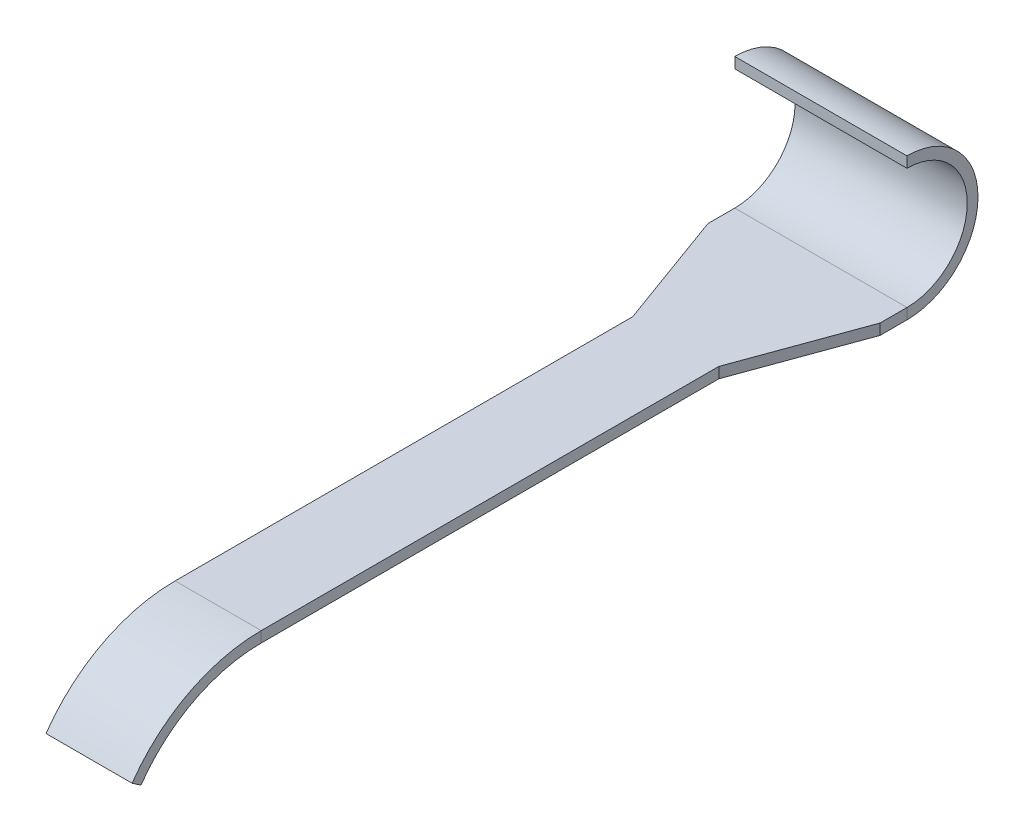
ISO-10303-21;
HEADER;
FILE_DESCRIPTION(('STEP AP214'),'2;1');
FILE_NAME('part.step','',(''),(''),'','','');
FILE_SCHEMA(('AUTOMOTIVE_DESIGN { 1 0 10303 214 1 1 1 1 }'));
ENDSEC;
DATA;
#1=APPLICATION_CONTEXT('core data for automotive mechanical design processes');
#2=APPLICATION_PROTOCOL_DEFINITION('international standard','automotive_design',2000,#1);
#3=PRODUCT_CONTEXT('',#1,'mechanical');
#4=PRODUCT('Part','Part','',(#3));
#5=PRODUCT_RELATED_PRODUCT_CATEGORY('part','',(#4));
#6=PRODUCT_DEFINITION_FORMATION('','',#4);
#7=PRODUCT_DEFINITION_CONTEXT('part definition',#1,'design');
#8=PRODUCT_DEFINITION('design','',#6,#7);
#9=PRODUCT_DEFINITION_SHAPE('','',#8);
#10=(LENGTH_UNIT() NAMED_UNIT(*) SI_UNIT(.MILLI.,.METRE.));
#11=(NAMED_UNIT(*) PLANE_ANGLE_UNIT() SI_UNIT($,.RADIAN.));
#12=(NAMED_UNIT(*) SI_UNIT($,.STERADIAN.) SOLID_ANGLE_UNIT());
#13=UNCERTAINTY_MEASURE_WITH_UNIT(LENGTH_MEASURE(1.E-05),#10,'distance_accuracy_value','');
#14=(GEOMETRIC_REPRESENTATION_CONTEXT(3) GLOBAL_UNCERTAINTY_ASSIGNED_CONTEXT((#13)) GLOBAL_UNIT_ASSIGNED_CONTEXT((#10,
#11,#12)) REPRESENTATION_CONTEXT('',''));
#15=CARTESIAN_POINT('',(0.,0.,0.));
#16=DIRECTION('',(0.,0.,1.));
#17=DIRECTION('',(1.,0.,0.));
#18=AXIS2_PLACEMENT_3D('',#15,#16,#17);
#19=CARTESIAN_POINT('',(19.05,-21.59,0.));
#20=DIRECTION('',(1.,0.,0.));
#21=DIRECTION('',(0.,0.,-1.));
#22=AXIS2_PLACEMENT_3D('',#19,#20,#21);
#23=PLANE('',#22);
#24=DIRECTION('',(0.,0.569606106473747,0.821917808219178));
#25=VECTOR('',#24,1.);
#26=CARTESIAN_POINT('',(19.05,-8.38795446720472,19.05));
#27=LINE('',#26,#25);
#28=CARTESIAN_POINT('',(19.05,-9.29220416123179,17.7452054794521));
#29=VERTEX_POINT('',#28);
#30=CARTESIAN_POINT('',(19.05,-8.38795446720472,19.05));
#31=VERTEX_POINT('',#30);
#32=EDGE_CURVE('E11',#29,#31,#27,.T.);
#33=ORIENTED_EDGE('',*,*,#32,.F.);
#34=CARTESIAN_POINT('',(19.05,-21.59,0.));
#35=DIRECTION('',(-1.,0.,0.));
#36=DIRECTION('',(0.,0.,1.));
#37=AXIS2_PLACEMENT_3D('',#34,#35,#36);
#38=CIRCLE('',#37,21.59);
#39=CARTESIAN_POINT('',(19.05,0.,0.));
#40=VERTEX_POINT('',#39);
#41=EDGE_CURVE('E118',#29,#40,#38,.T.);
#42=ORIENTED_EDGE('',*,*,#41,.T.);
#43=DIRECTION('',(0.,1.,0.));
#44=VECTOR('',#43,1.);
#45=CARTESIAN_POINT('',(19.05,1.5875,0.));
#46=LINE('',#45,#44);
#47=CARTESIAN_POINT('',(19.05,1.5875,0.));
#48=VERTEX_POINT('',#47);
#49=EDGE_CURVE('E51',#40,#48,#46,.T.);
#50=ORIENTED_EDGE('',*,*,#49,.T.);
#51=CARTESIAN_POINT('',(19.05,-21.59,0.));
#52=DIRECTION('',(-1.,0.,0.));
#53=DIRECTION('',(0.,0.,1.));
#54=AXIS2_PLACEMENT_3D('',#51,#52,#53);
#55=CIRCLE('',#54,23.1775);
#56=EDGE_CURVE('E111',#31,#48,#55,.T.);
#57=ORIENTED_EDGE('',*,*,#56,.F.);
#58=EDGE_LOOP('',(#33,#42,#50,#57));
#59=FACE_BOUND('',#58,.T.);
#60=ADVANCED_FACE('F41',(#59),#23,.T.);
#61=CARTESIAN_POINT('',(19.05,1.5875,19.05));
#62=DIRECTION('',(1.,0.,0.));
#63=DIRECTION('',(0.,0.,1.));
#64=AXIS2_PLACEMENT_3D('',#61,#62,#63);
#65=PLANE('',#64);
#66=ORIENTED_EDGE('',*,*,#49,.F.);
#67=DIRECTION('',(0.,0.,-1.));
#68=VECTOR('',#67,1.);
#69=CARTESIAN_POINT('',(19.05,0.,0.));
#70=LINE('',#69,#68);
#71=CARTESIAN_POINT('',(19.05,0.,-67.4932743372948));
#72=VERTEX_POINT('',#71);
#73=EDGE_CURVE('E153',#72,#40,#70,.F.);
#74=ORIENTED_EDGE('',*,*,#73,.F.);
#75=DIRECTION('',(0.,1.,0.));
#76=VECTOR('',#75,1.);
#77=CARTESIAN_POINT('',(19.05,1.5875,-67.4932743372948));
#78=LINE('',#77,#76);
#79=CARTESIAN_POINT('',(19.05,1.5875,-67.4932743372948));
#80=VERTEX_POINT('',#79);
#81=EDGE_CURVE('E179',#72,#80,#78,.T.);
#82=ORIENTED_EDGE('',*,*,#81,.T.);
#83=DIRECTION('',(0.,0.,1.));
#84=VECTOR('',#83,1.);
#85=CARTESIAN_POINT('',(19.05,1.5875,19.05));
#86=LINE('',#85,#84);
#87=EDGE_CURVE('E192',#80,#48,#86,.T.);
#88=ORIENTED_EDGE('',*,*,#87,.T.);
#89=EDGE_LOOP('',(#66,#74,#82,#88));
#90=FACE_BOUND('',#89,.T.);
#91=ADVANCED_FACE('F193',(#90),#65,.T.);
#92=CARTESIAN_POINT('',(19.05,1.5875,-67.4932743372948));
#93=DIRECTION('',(0.939692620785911,0.,0.342020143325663));
#94=DIRECTION('',(-0.342020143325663,0.,0.93969262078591));
#95=AXIS2_PLACEMENT_3D('',#92,#93,#94);
#96=PLANE('',#95);
#97=ORIENTED_EDGE('',*,*,#81,.F.);
#98=DIRECTION('',(-0.342020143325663,0.,0.93969262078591));
#99=VECTOR('',#98,1.);
#100=CARTESIAN_POINT('',(19.05,0.,-67.4932743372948));
#101=LINE('',#100,#99);
#102=CARTESIAN_POINT('',(25.4,0.,-84.939755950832));
#103=VERTEX_POINT('',#102);
#104=EDGE_CURVE('E150',#103,#72,#101,.T.);
#105=ORIENTED_EDGE('',*,*,#104,.F.);
#106=DIRECTION('',(0.,1.,0.));
#107=VECTOR('',#106,1.);
#108=CARTESIAN_POINT('',(25.4,1.5875,-84.939755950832));
#109=LINE('',#108,#107);
#110=CARTESIAN_POINT('',(25.4,1.5875,-84.939755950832));
#111=VERTEX_POINT('',#110);
#112=EDGE_CURVE('E176',#103,#111,#109,.T.);
#113=ORIENTED_EDGE('',*,*,#112,.T.);
#114=DIRECTION('',(-0.342020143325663,0.,0.93969262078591));
#115=VECTOR('',#114,1.);
#116=CARTESIAN_POINT('',(19.05,1.5875,-67.4932743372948));
#117=LINE('',#116,#115);
#118=EDGE_CURVE('E198',#111,#80,#117,.T.);
#119=ORIENTED_EDGE('',*,*,#118,.T.);
#120=EDGE_LOOP('',(#97,#105,#113,#119));
#121=FACE_BOUND('',#120,.T.);
#122=ADVANCED_FACE('F242',(#121),#96,.T.);
#123=CARTESIAN_POINT('',(25.4,1.5875,0.));
#124=DIRECTION('',(1.,0.,0.));
#125=DIRECTION('',(0.,0.,1.));
#126=AXIS2_PLACEMENT_3D('',#123,#124,#125);
#127=PLANE('',#126);
#128=ORIENTED_EDGE('',*,*,#112,.F.);
#129=DIRECTION('',(0.,0.,-1.));
#130=VECTOR('',#129,1.);
#131=CARTESIAN_POINT('',(25.4,0.,0.));
#132=LINE('',#131,#130);
#133=CARTESIAN_POINT('',(25.4,0.,-88.9));
#134=VERTEX_POINT('',#133);
#135=EDGE_CURVE('E147',#134,#103,#132,.F.);
#136=ORIENTED_EDGE('',*,*,#135,.F.);
#137=DIRECTION('',(0.,1.,0.));
#138=VECTOR('',#137,1.);
#139=CARTESIAN_POINT('',(25.4,1.5875,-88.9));
#140=LINE('',#139,#138);
#141=CARTESIAN_POINT('',(25.4,1.5875,-88.9));
#142=VERTEX_POINT('',#141);
#143=EDGE_CURVE('E173',#134,#142,#140,.T.);
#144=ORIENTED_EDGE('',*,*,#143,.T.);
#145=DIRECTION('',(0.,0.,1.));
#146=VECTOR('',#145,1.);
#147=CARTESIAN_POINT('',(25.4,1.5875,0.));
#148=LINE('',#147,#146);
#149=EDGE_CURVE('E217',#142,#111,#148,.T.);
#150=ORIENTED_EDGE('',*,*,#149,.T.);
#151=EDGE_LOOP('',(#128,#136,#144,#150));
#152=FACE_BOUND('',#151,.T.);
#153=ADVANCED_FACE('F249',(#152),#127,.T.);
#154=CARTESIAN_POINT('',(25.4,10.4775,-88.9));
#155=DIRECTION('',(1.,0.,0.));
#156=DIRECTION('',(0.,0.,-1.));
#157=AXIS2_PLACEMENT_3D('',#154,#155,#156);
#158=PLANE('',#157);
#159=ORIENTED_EDGE('',*,*,#143,.F.);
#160=CARTESIAN_POINT('',(25.4,10.4775,-88.9));
#161=DIRECTION('',(-1.,0.,0.));
#162=DIRECTION('',(0.,0.,1.));
#163=AXIS2_PLACEMENT_3D('',#160,#161,#162);
#164=CIRCLE('',#163,10.4775);
#165=CARTESIAN_POINT('',(25.4,20.955,-88.9));
#166=VERTEX_POINT('',#165);
#167=EDGE_CURVE('E126',#166,#134,#164,.T.);
#168=ORIENTED_EDGE('',*,*,#167,.F.);
#169=DIRECTION('',(0.,-1.,0.));
#170=VECTOR('',#169,1.);
#171=CARTESIAN_POINT('',(25.4,19.3675,-88.9));
#172=LINE('',#171,#170);
#173=CARTESIAN_POINT('',(25.4,19.3675,-88.9));
#174=VERTEX_POINT('',#173);
#175=EDGE_CURVE('E170',#166,#174,#172,.T.);
#176=ORIENTED_EDGE('',*,*,#175,.T.);
#177=CARTESIAN_POINT('',(25.4,10.4775,-88.9));
#178=DIRECTION('',(-1.,0.,0.));
#179=DIRECTION('',(0.,0.,-1.));
#180=AXIS2_PLACEMENT_3D('',#177,#178,#179);
#181=CIRCLE('',#180,8.89);
#182=EDGE_CURVE('E226',#174,#142,#181,.T.);
#183=ORIENTED_EDGE('',*,*,#182,.T.);
#184=EDGE_LOOP('',(#159,#168,#176,#183));
#185=FACE_BOUND('',#184,.T.);
#186=ADVANCED_FACE('F254',(#185),#158,.T.);
#187=CARTESIAN_POINT('',(12.7,19.3675,-88.9));
#188=DIRECTION('',(0.,0.,-1.));
#189=DIRECTION('',(-1.,0.,0.));
#190=AXIS2_PLACEMENT_3D('',#187,#188,#189);
#191=PLANE('',#190);
#192=ORIENTED_EDGE('',*,*,#175,.F.);
#193=DIRECTION('',(-1.,0.,0.));
#194=VECTOR('',#193,1.);
#195=CARTESIAN_POINT('',(25.4,20.955,-88.9));
#196=LINE('',#195,#194);
#197=CARTESIAN_POINT('',(0.,20.955,-88.9));
#198=VERTEX_POINT('',#197);
#199=EDGE_CURVE('E123',#166,#198,#196,.T.);
#200=ORIENTED_EDGE('',*,*,#199,.T.);
#201=DIRECTION('',(0.,-1.,0.));
#202=VECTOR('',#201,1.);
#203=CARTESIAN_POINT('',(0.,19.3675,-88.9));
#204=LINE('',#203,#202);
#205=CARTESIAN_POINT('',(0.,19.3675,-88.9));
#206=VERTEX_POINT('',#205);
#207=EDGE_CURVE('E167',#198,#206,#204,.T.);
#208=ORIENTED_EDGE('',*,*,#207,.T.);
#209=DIRECTION('',(-1.,0.,0.));
#210=VECTOR('',#209,1.);
#211=CARTESIAN_POINT('',(25.4,19.3675,-88.9));
#212=LINE('',#211,#210);
#213=EDGE_CURVE('E229',#174,#206,#212,.T.);
#214=ORIENTED_EDGE('',*,*,#213,.F.);
#215=EDGE_LOOP('',(#192,#200,#208,#214));
#216=FACE_BOUND('',#215,.T.);
#217=ADVANCED_FACE('F263',(#216),#191,.F.);
#218=CARTESIAN_POINT('',(0.,10.4775,-88.9));
#219=DIRECTION('',(1.,0.,0.));
#220=DIRECTION('',(0.,0.,-1.));
#221=AXIS2_PLACEMENT_3D('',#218,#219,#220);
#222=PLANE('',#221);
#223=ORIENTED_EDGE('',*,*,#207,.F.);
#224=CARTESIAN_POINT('',(0.,10.4775,-88.9));
#225=DIRECTION('',(-1.,0.,0.));
#226=DIRECTION('',(0.,0.,1.));
#227=AXIS2_PLACEMENT_3D('',#224,#225,#226);
#228=CIRCLE('',#227,10.4775);
#229=CARTESIAN_POINT('',(0.,0.,-88.9));
#230=VERTEX_POINT('',#229);
#231=EDGE_CURVE('E142',#198,#230,#228,.T.);
#232=ORIENTED_EDGE('',*,*,#231,.T.);
#233=DIRECTION('',(0.,1.,0.));
#234=VECTOR('',#233,1.);
#235=CARTESIAN_POINT('',(0.,1.5875,-88.9));
#236=LINE('',#235,#234);
#237=CARTESIAN_POINT('',(0.,1.5875,-88.9));
#238=VERTEX_POINT('',#237);
#239=EDGE_CURVE('E164',#230,#238,#236,.T.);
#240=ORIENTED_EDGE('',*,*,#239,.T.);
#241=CARTESIAN_POINT('',(0.,10.4775,-88.9));
#242=DIRECTION('',(-1.,0.,0.));
#243=DIRECTION('',(0.,0.,-1.));
#244=AXIS2_PLACEMENT_3D('',#241,#242,#243);
#245=CIRCLE('',#244,8.89);
#246=EDGE_CURVE('E223',#206,#238,#245,.T.);
#247=ORIENTED_EDGE('',*,*,#246,.F.);
#248=EDGE_LOOP('',(#223,#232,#240,#247));
#249=FACE_BOUND('',#248,.T.);
#250=ADVANCED_FACE('F303',(#249),#222,.F.);
#251=CARTESIAN_POINT('',(0.,1.5875,0.));
#252=DIRECTION('',(1.,0.,0.));
#253=DIRECTION('',(0.,0.,1.));
#254=AXIS2_PLACEMENT_3D('',#251,#252,#253);
#255=PLANE('',#254);
#256=ORIENTED_EDGE('',*,*,#239,.F.);
#257=DIRECTION('',(0.,0.,-1.));
#258=VECTOR('',#257,1.);
#259=CARTESIAN_POINT('',(0.,0.,0.));
#260=LINE('',#259,#258);
#261=CARTESIAN_POINT('',(0.,0.,-84.939755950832));
#262=VERTEX_POINT('',#261);
#263=EDGE_CURVE('E139',#230,#262,#260,.F.);
#264=ORIENTED_EDGE('',*,*,#263,.T.);
#265=DIRECTION('',(0.,1.,0.));
#266=VECTOR('',#265,1.);
#267=CARTESIAN_POINT('',(0.,1.5875,-84.939755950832));
#268=LINE('',#267,#266);
#269=CARTESIAN_POINT('',(0.,1.5875,-84.939755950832));
#270=VERTEX_POINT('',#269);
#271=EDGE_CURVE('E162',#262,#270,#268,.T.);
#272=ORIENTED_EDGE('',*,*,#271,.T.);
#273=DIRECTION('',(0.,0.,1.));
#274=VECTOR('',#273,1.);
#275=CARTESIAN_POINT('',(0.,1.5875,0.));
#276=LINE('',#275,#274);
#277=EDGE_CURVE('E156',#238,#270,#276,.T.);
#278=ORIENTED_EDGE('',*,*,#277,.F.);
#279=EDGE_LOOP('',(#256,#264,#272,#278));
#280=FACE_BOUND('',#279,.T.);
#281=ADVANCED_FACE('F287',(#280),#255,.F.);
#282=CARTESIAN_POINT('',(0.,1.5875,-84.939755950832));
#283=DIRECTION('',(-0.939692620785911,0.,0.342020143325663));
#284=DIRECTION('',(-0.342020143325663,0.,-0.939692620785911));
#285=AXIS2_PLACEMENT_3D('',#282,#283,#284);
#286=PLANE('',#285);
#287=ORIENTED_EDGE('',*,*,#271,.F.);
#288=DIRECTION('',(-0.342020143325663,0.,-0.939692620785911));
#289=VECTOR('',#288,1.);
#290=CARTESIAN_POINT('',(0.,0.,-84.939755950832));
#291=LINE('',#290,#289);
#292=CARTESIAN_POINT('',(6.35,0.,-67.4932743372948));
#293=VERTEX_POINT('',#292);
#294=EDGE_CURVE('E136',#293,#262,#291,.T.);
#295=ORIENTED_EDGE('',*,*,#294,.F.);
#296=DIRECTION('',(0.,1.,0.));
#297=VECTOR('',#296,1.);
#298=CARTESIAN_POINT('',(6.35,1.5875,-67.4932743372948));
#299=LINE('',#298,#297);
#300=CARTESIAN_POINT('',(6.35,1.5875,-67.4932743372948));
#301=VERTEX_POINT('',#300);
#302=EDGE_CURVE('E159',#293,#301,#299,.T.);
#303=ORIENTED_EDGE('',*,*,#302,.T.);
#304=DIRECTION('',(-0.342020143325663,0.,-0.939692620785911));
#305=VECTOR('',#304,1.);
#306=CARTESIAN_POINT('',(0.,1.5875,-84.939755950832));
#307=LINE('',#306,#305);
#308=EDGE_CURVE('E212',#301,#270,#307,.T.);
#309=ORIENTED_EDGE('',*,*,#308,.T.);
#310=EDGE_LOOP('',(#287,#295,#303,#309));
#311=FACE_BOUND('',#310,.T.);
#312=ADVANCED_FACE('F277',(#311),#286,.T.);
#313=CARTESIAN_POINT('',(6.35,1.5875,-67.4932743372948));
#314=DIRECTION('',(-1.,0.,0.));
#315=DIRECTION('',(0.,0.,-1.));
#316=AXIS2_PLACEMENT_3D('',#313,#314,#315);
#317=PLANE('',#316);
#318=ORIENTED_EDGE('',*,*,#302,.F.);
#319=DIRECTION('',(0.,0.,-1.));
#320=VECTOR('',#319,1.);
#321=CARTESIAN_POINT('',(6.35,0.,0.));
#322=LINE('',#321,#320);
#323=CARTESIAN_POINT('',(6.35,0.,0.));
#324=VERTEX_POINT('',#323);
#325=EDGE_CURVE('E132',#324,#293,#322,.T.);
#326=ORIENTED_EDGE('',*,*,#325,.F.);
#327=DIRECTION('',(0.,1.,0.));
#328=VECTOR('',#327,1.);
#329=CARTESIAN_POINT('',(6.35,1.5875,0.));
#330=LINE('',#329,#328);
#331=CARTESIAN_POINT('',(6.35,1.5875,0.));
#332=VERTEX_POINT('',#331);
#333=EDGE_CURVE('E110',#324,#332,#330,.T.);
#334=ORIENTED_EDGE('',*,*,#333,.T.);
#335=DIRECTION('',(0.,0.,-1.));
#336=VECTOR('',#335,1.);
#337=CARTESIAN_POINT('',(6.35,1.5875,-67.4932743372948));
#338=LINE('',#337,#336);
#339=EDGE_CURVE('E210',#332,#301,#338,.T.);
#340=ORIENTED_EDGE('',*,*,#339,.T.);
#341=EDGE_LOOP('',(#318,#326,#334,#340));
#342=FACE_BOUND('',#341,.T.);
#343=ADVANCED_FACE('F279',(#342),#317,.T.);
#344=CARTESIAN_POINT('',(6.35,-21.59,0.));
#345=DIRECTION('',(-1.,0.,0.));
#346=DIRECTION('',(0.,0.,1.));
#347=AXIS2_PLACEMENT_3D('',#344,#345,#346);
#348=PLANE('',#347);
#349=ORIENTED_EDGE('',*,*,#333,.F.);
#350=CARTESIAN_POINT('',(6.35,-21.59,0.));
#351=DIRECTION('',(-1.,0.,0.));
#352=DIRECTION('',(0.,0.,1.));
#353=AXIS2_PLACEMENT_3D('',#350,#351,#352);
#354=CIRCLE('',#353,21.59);
#355=CARTESIAN_POINT('',(6.35,-9.29220416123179,17.7452054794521));
#356=VERTEX_POINT('',#355);
#357=EDGE_CURVE('E116',#324,#356,#354,.F.);
#358=ORIENTED_EDGE('',*,*,#357,.T.);
#359=DIRECTION('',(0.,0.569606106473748,0.821917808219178));
#360=VECTOR('',#359,1.);
#361=CARTESIAN_POINT('',(6.35,-8.38795446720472,19.05));
#362=LINE('',#361,#360);
#363=CARTESIAN_POINT('',(6.35,-8.38795446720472,19.05));
#364=VERTEX_POINT('',#363);
#365=EDGE_CURVE('E45',#356,#364,#362,.T.);
#366=ORIENTED_EDGE('',*,*,#365,.T.);
#367=CARTESIAN_POINT('',(6.35,-21.59,0.));
#368=DIRECTION('',(1.,0.,0.));
#369=DIRECTION('',(0.,0.,-1.));
#370=AXIS2_PLACEMENT_3D('',#367,#368,#369);
#371=CIRCLE('',#370,23.1775);
#372=EDGE_CURVE('E232',#332,#364,#371,.T.);
#373=ORIENTED_EDGE('',*,*,#372,.F.);
#374=EDGE_LOOP('',(#349,#358,#366,#373));
#375=FACE_BOUND('',#374,.T.);
#376=ADVANCED_FACE('F120',(#375),#348,.T.);
#377=CARTESIAN_POINT('',(12.7,-8.38795446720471,19.05));
#378=DIRECTION('',(0.,0.821917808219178,-0.569606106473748));
#379=DIRECTION('',(-1.,0.,0.));
#380=AXIS2_PLACEMENT_3D('',#377,#378,#379);
#381=PLANE('',#380);
#382=DIRECTION('',(-1.,0.,0.));
#383=VECTOR('',#382,1.);
#384=CARTESIAN_POINT('',(25.4,-9.29220416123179,17.7452054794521));
#385=LINE('',#384,#383);
#386=EDGE_CURVE('E103',#29,#356,#385,.T.);
#387=ORIENTED_EDGE('',*,*,#386,.F.);
#388=ORIENTED_EDGE('',*,*,#32,.T.);
#389=DIRECTION('',(-1.,0.,0.));
#390=VECTOR('',#389,1.);
#391=CARTESIAN_POINT('',(25.4,-8.38795446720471,19.05));
#392=LINE('',#391,#390);
#393=EDGE_CURVE('E105',#31,#364,#392,.T.);
#394=ORIENTED_EDGE('',*,*,#393,.T.);
#395=ORIENTED_EDGE('',*,*,#365,.F.);
#396=EDGE_LOOP('',(#387,#388,#394,#395));
#397=FACE_BOUND('',#396,.T.);
#398=ADVANCED_FACE('F43',(#397),#381,.F.);
#399=CARTESIAN_POINT('',(25.4,-21.59,0.));
#400=DIRECTION('',(-1.,0.,0.));
#401=DIRECTION('',(0.,0.,1.));
#402=AXIS2_PLACEMENT_3D('',#399,#400,#401);
#403=CYLINDRICAL_SURFACE('',#402,23.1775);
#404=DIRECTION('',(-1.,0.,0.));
#405=VECTOR('',#404,1.);
#406=CARTESIAN_POINT('',(25.4,1.5875,0.));
#407=LINE('',#406,#405);
#408=EDGE_CURVE('E199',#48,#332,#407,.T.);
#409=ORIENTED_EDGE('',*,*,#408,.T.);
#410=ORIENTED_EDGE('',*,*,#372,.T.);
#411=ORIENTED_EDGE('',*,*,#393,.F.);
#412=ORIENTED_EDGE('',*,*,#56,.T.);
#413=EDGE_LOOP('',(#409,#410,#411,#412));
#414=FACE_BOUND('',#413,.T.);
#415=ADVANCED_FACE('F203',(#414),#403,.T.);
#416=CARTESIAN_POINT('',(25.4,10.4775,-88.9));
#417=DIRECTION('',(-1.,0.,0.));
#418=DIRECTION('',(0.,0.,1.));
#419=AXIS2_PLACEMENT_3D('',#416,#417,#418);
#420=CYLINDRICAL_SURFACE('',#419,8.89);
#421=ORIENTED_EDGE('',*,*,#246,.T.);
#422=DIRECTION('',(-1.,0.,0.));
#423=VECTOR('',#422,1.);
#424=CARTESIAN_POINT('',(25.4,1.5875,-88.9));
#425=LINE('',#424,#423);
#426=EDGE_CURVE('E220',#142,#238,#425,.T.);
#427=ORIENTED_EDGE('',*,*,#426,.F.);
#428=ORIENTED_EDGE('',*,*,#182,.F.);
#429=ORIENTED_EDGE('',*,*,#213,.T.);
#430=EDGE_LOOP('',(#421,#427,#428,#429));
#431=FACE_BOUND('',#430,.T.);
#432=ADVANCED_FACE('F268',(#431),#420,.F.);
#433=CARTESIAN_POINT('',(25.4,1.5875,0.));
#434=DIRECTION('',(0.,-1.,0.));
#435=DIRECTION('',(0.,0.,-1.));
#436=AXIS2_PLACEMENT_3D('',#433,#434,#435);
#437=PLANE('',#436);
#438=ORIENTED_EDGE('',*,*,#277,.T.);
#439=ORIENTED_EDGE('',*,*,#308,.F.);
#440=ORIENTED_EDGE('',*,*,#339,.F.);
#441=ORIENTED_EDGE('',*,*,#408,.F.);
#442=ORIENTED_EDGE('',*,*,#87,.F.);
#443=ORIENTED_EDGE('',*,*,#118,.F.);
#444=ORIENTED_EDGE('',*,*,#149,.F.);
#445=ORIENTED_EDGE('',*,*,#426,.T.);
#446=EDGE_LOOP('',(#438,#439,#440,#441,#442,#443,#444,#445));
#447=FACE_BOUND('',#446,.T.);
#448=ADVANCED_FACE('F207',(#447),#437,.F.);
#449=CARTESIAN_POINT('',(25.4,-21.59,0.));
#450=DIRECTION('',(-1.,0.,0.));
#451=DIRECTION('',(0.,0.,1.));
#452=AXIS2_PLACEMENT_3D('',#449,#450,#451);
#453=CYLINDRICAL_SURFACE('',#452,21.59);
#454=DIRECTION('',(-1.,0.,0.));
#455=VECTOR('',#454,1.);
#456=CARTESIAN_POINT('',(25.4,0.,0.));
#457=LINE('',#456,#455);
#458=EDGE_CURVE('E135',#40,#324,#457,.T.);
#459=ORIENTED_EDGE('',*,*,#458,.F.);
#460=ORIENTED_EDGE('',*,*,#41,.F.);
#461=ORIENTED_EDGE('',*,*,#386,.T.);
#462=ORIENTED_EDGE('',*,*,#357,.F.);
#463=EDGE_LOOP('',(#459,#460,#461,#462));
#464=FACE_BOUND('',#463,.T.);
#465=ADVANCED_FACE('F115',(#464),#453,.F.);
#466=CARTESIAN_POINT('',(25.4,10.4775,-88.9));
#467=DIRECTION('',(-1.,0.,0.));
#468=DIRECTION('',(0.,0.,1.));
#469=AXIS2_PLACEMENT_3D('',#466,#467,#468);
#470=CYLINDRICAL_SURFACE('',#469,10.4775);
#471=ORIENTED_EDGE('',*,*,#231,.F.);
#472=ORIENTED_EDGE('',*,*,#199,.F.);
#473=ORIENTED_EDGE('',*,*,#167,.T.);
#474=DIRECTION('',(1.,0.,0.));
#475=VECTOR('',#474,1.);
#476=CARTESIAN_POINT('',(25.4,0.,-88.9));
#477=LINE('',#476,#475);
#478=EDGE_CURVE('E130',#134,#230,#477,.F.);
#479=ORIENTED_EDGE('',*,*,#478,.T.);
#480=EDGE_LOOP('',(#471,#472,#473,#479));
#481=FACE_BOUND('',#480,.T.);
#482=ADVANCED_FACE('F261',(#481),#470,.T.);
#483=CARTESIAN_POINT('',(25.4,0.,0.));
#484=DIRECTION('',(0.,-1.,0.));
#485=DIRECTION('',(0.,0.,-1.));
#486=AXIS2_PLACEMENT_3D('',#483,#484,#485);
#487=PLANE('',#486);
#488=ORIENTED_EDGE('',*,*,#263,.F.);
#489=ORIENTED_EDGE('',*,*,#478,.F.);
#490=ORIENTED_EDGE('',*,*,#135,.T.);
#491=ORIENTED_EDGE('',*,*,#104,.T.);
#492=ORIENTED_EDGE('',*,*,#73,.T.);
#493=ORIENTED_EDGE('',*,*,#458,.T.);
#494=ORIENTED_EDGE('',*,*,#325,.T.);
#495=ORIENTED_EDGE('',*,*,#294,.T.);
#496=EDGE_LOOP('',(#488,#489,#490,#491,#492,#493,#494,#495));
#497=FACE_BOUND('',#496,.T.);
#498=ADVANCED_FACE('F236',(#497),#487,.T.);
#499=CLOSED_SHELL('',(#60,#91,#122,#153,#186,#217,#250,#281,#312,#343,#376,#398,#415,#432,#448,
#465,#482,#498));
#500=MANIFOLD_SOLID_BREP('B2',#499);
#501=ADVANCED_BREP_SHAPE_REPRESENTATION('',(#18,#500),#14);
#502=SHAPE_DEFINITION_REPRESENTATION(#9,#501);
ENDSEC;
END-ISO-10303-21;
